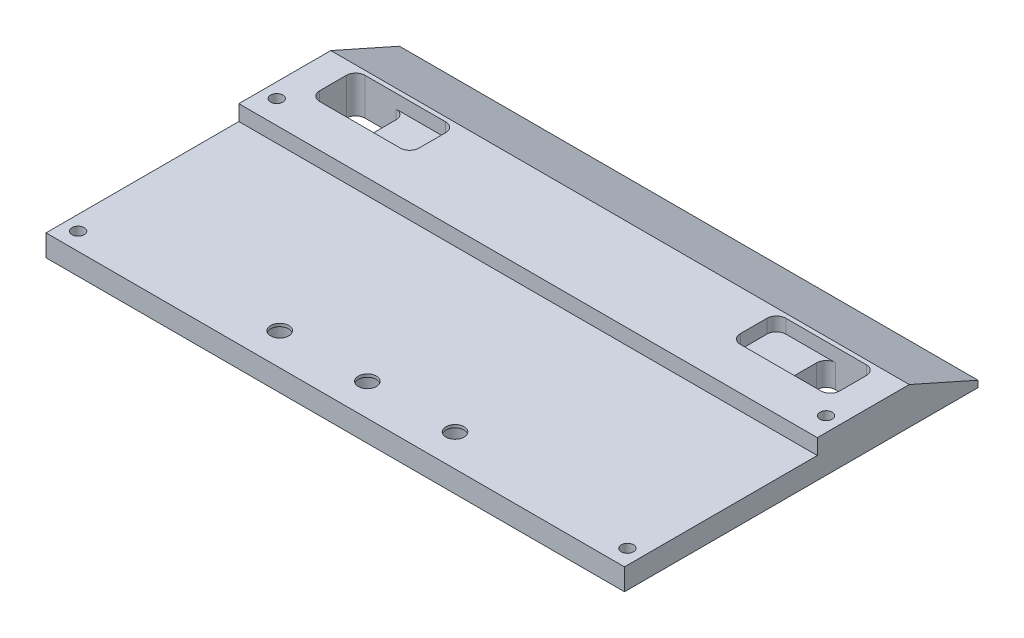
ISO-10303-21;
HEADER;
FILE_DESCRIPTION(('STEP AP214'),'2;1');
FILE_NAME('part.step','',(''),(''),'','','');
FILE_SCHEMA(('AUTOMOTIVE_DESIGN { 1 0 10303 214 1 1 1 1 }'));
ENDSEC;
DATA;
#1=APPLICATION_CONTEXT('core data for automotive mechanical design processes');
#2=APPLICATION_PROTOCOL_DEFINITION('international standard','automotive_design',2000,#1);
#3=PRODUCT_CONTEXT('',#1,'mechanical');
#4=PRODUCT('Part','Part','',(#3));
#5=PRODUCT_RELATED_PRODUCT_CATEGORY('part','',(#4));
#6=PRODUCT_DEFINITION_FORMATION('','',#4);
#7=PRODUCT_DEFINITION_CONTEXT('part definition',#1,'design');
#8=PRODUCT_DEFINITION('design','',#6,#7);
#9=PRODUCT_DEFINITION_SHAPE('','',#8);
#10=(LENGTH_UNIT() NAMED_UNIT(*) SI_UNIT(.MILLI.,.METRE.));
#11=(NAMED_UNIT(*) PLANE_ANGLE_UNIT() SI_UNIT($,.RADIAN.));
#12=(NAMED_UNIT(*) SI_UNIT($,.STERADIAN.) SOLID_ANGLE_UNIT());
#13=UNCERTAINTY_MEASURE_WITH_UNIT(LENGTH_MEASURE(1.E-05),#10,'distance_accuracy_value','');
#14=(GEOMETRIC_REPRESENTATION_CONTEXT(3) GLOBAL_UNCERTAINTY_ASSIGNED_CONTEXT((#13)) GLOBAL_UNIT_ASSIGNED_CONTEXT((#10,
#11,#12)) REPRESENTATION_CONTEXT('',''));
#15=CARTESIAN_POINT('',(0.,0.,0.));
#16=DIRECTION('',(0.,0.,1.));
#17=DIRECTION('',(1.,0.,0.));
#18=AXIS2_PLACEMENT_3D('',#15,#16,#17);
#19=CARTESIAN_POINT('',(-78.6,0.,-77.4));
#20=DIRECTION('',(0.,1.,0.));
#21=DIRECTION('',(0.,0.,1.));
#22=AXIS2_PLACEMENT_3D('',#19,#20,#21);
#23=CYLINDRICAL_SURFACE('',#22,1.6);
#24=CARTESIAN_POINT('',(-78.6,4.,-77.4));
#25=DIRECTION('',(0.,-1.,0.));
#26=DIRECTION('',(0.,0.,-1.));
#27=AXIS2_PLACEMENT_3D('',#24,#25,#26);
#28=CIRCLE('',#27,1.6);
#29=CARTESIAN_POINT('',(-78.6,4.,-79.));
#30=VERTEX_POINT('',#29);
#31=CARTESIAN_POINT('',(-77.,4.,-77.4));
#32=VERTEX_POINT('',#31);
#33=EDGE_CURVE('E286',#30,#32,#28,.T.);
#34=ORIENTED_EDGE('',*,*,#33,.T.);
#35=DIRECTION('',(0.,1.,0.));
#36=VECTOR('',#35,1.);
#37=CARTESIAN_POINT('',(-77.,0.,-77.4));
#38=LINE('',#37,#36);
#39=CARTESIAN_POINT('',(-77.,6.35,-77.4));
#40=VERTEX_POINT('',#39);
#41=EDGE_CURVE('E301',#32,#40,#38,.T.);
#42=ORIENTED_EDGE('',*,*,#41,.T.);
#43=CARTESIAN_POINT('',(-78.6,6.35,-77.4));
#44=DIRECTION('',(0.,1.,0.));
#45=DIRECTION('',(0.,0.,-1.));
#46=AXIS2_PLACEMENT_3D('',#43,#44,#45);
#47=CIRCLE('',#46,1.6);
#48=CARTESIAN_POINT('',(-78.6,6.35,-79.));
#49=VERTEX_POINT('',#48);
#50=EDGE_CURVE('E364',#40,#49,#47,.T.);
#51=ORIENTED_EDGE('',*,*,#50,.T.);
#52=DIRECTION('',(0.,1.,0.));
#53=VECTOR('',#52,1.);
#54=CARTESIAN_POINT('',(-78.6,0.,-79.));
#55=LINE('',#54,#53);
#56=EDGE_CURVE('E401',#30,#49,#55,.T.);
#57=ORIENTED_EDGE('',*,*,#56,.F.);
#58=EDGE_LOOP('',(#34,#42,#51,#57));
#59=FACE_BOUND('',#58,.T.);
#60=ADVANCED_FACE('F47',(#59),#23,.F.);
#61=CARTESIAN_POINT('',(-77.,0.,-77.4));
#62=DIRECTION('',(1.,0.,0.));
#63=DIRECTION('',(0.,0.,-1.));
#64=AXIS2_PLACEMENT_3D('',#61,#62,#63);
#65=PLANE('',#64);
#66=DIRECTION('',(0.,0.,1.));
#67=VECTOR('',#66,1.);
#68=CARTESIAN_POINT('',(-77.,4.,-72.83));
#69=LINE('',#68,#67);
#70=CARTESIAN_POINT('',(-77.,4.,-72.83));
#71=VERTEX_POINT('',#70);
#72=EDGE_CURVE('E289',#32,#71,#69,.T.);
#73=ORIENTED_EDGE('',*,*,#72,.T.);
#74=DIRECTION('',(0.,1.,0.));
#75=VECTOR('',#74,1.);
#76=CARTESIAN_POINT('',(-77.,0.,-72.83));
#77=LINE('',#76,#75);
#78=CARTESIAN_POINT('',(-77.,6.35,-72.83));
#79=VERTEX_POINT('',#78);
#80=EDGE_CURVE('E414',#71,#79,#77,.T.);
#81=ORIENTED_EDGE('',*,*,#80,.T.);
#82=DIRECTION('',(0.,0.,-1.));
#83=VECTOR('',#82,1.);
#84=CARTESIAN_POINT('',(-77.,6.35,-77.4));
#85=LINE('',#84,#83);
#86=EDGE_CURVE('E417',#79,#40,#85,.T.);
#87=ORIENTED_EDGE('',*,*,#86,.T.);
#88=ORIENTED_EDGE('',*,*,#41,.F.);
#89=EDGE_LOOP('',(#73,#81,#87,#88));
#90=FACE_BOUND('',#89,.T.);
#91=ADVANCED_FACE('F578',(#90),#65,.F.);
#92=CARTESIAN_POINT('',(-78.6,0.,-72.83));
#93=DIRECTION('',(0.,1.,0.));
#94=DIRECTION('',(0.,0.,1.));
#95=AXIS2_PLACEMENT_3D('',#92,#93,#94);
#96=CYLINDRICAL_SURFACE('',#95,1.6);
#97=CARTESIAN_POINT('',(-78.6,4.,-72.83));
#98=DIRECTION('',(0.,-1.,0.));
#99=DIRECTION('',(0.,0.,-1.));
#100=AXIS2_PLACEMENT_3D('',#97,#98,#99);
#101=CIRCLE('',#100,1.6);
#102=CARTESIAN_POINT('',(-78.6,4.,-71.23));
#103=VERTEX_POINT('',#102);
#104=EDGE_CURVE('E292',#71,#103,#101,.T.);
#105=ORIENTED_EDGE('',*,*,#104,.T.);
#106=DIRECTION('',(0.,1.,0.));
#107=VECTOR('',#106,1.);
#108=CARTESIAN_POINT('',(-78.6,0.,-71.23));
#109=LINE('',#108,#107);
#110=CARTESIAN_POINT('',(-78.6,6.35,-71.23));
#111=VERTEX_POINT('',#110);
#112=EDGE_CURVE('E412',#103,#111,#109,.T.);
#113=ORIENTED_EDGE('',*,*,#112,.T.);
#114=CARTESIAN_POINT('',(-78.6,6.35,-72.83));
#115=DIRECTION('',(0.,1.,0.));
#116=DIRECTION('',(0.,0.,1.));
#117=AXIS2_PLACEMENT_3D('',#114,#115,#116);
#118=CIRCLE('',#117,1.6);
#119=EDGE_CURVE('E420',#111,#79,#118,.T.);
#120=ORIENTED_EDGE('',*,*,#119,.T.);
#121=ORIENTED_EDGE('',*,*,#80,.F.);
#122=EDGE_LOOP('',(#105,#113,#120,#121));
#123=FACE_BOUND('',#122,.T.);
#124=ADVANCED_FACE('F585',(#123),#96,.F.);
#125=CARTESIAN_POINT('',(-92.4,0.,-71.23));
#126=DIRECTION('',(0.,0.,1.));
#127=DIRECTION('',(0.,-1.,0.));
#128=AXIS2_PLACEMENT_3D('',#125,#126,#127);
#129=PLANE('',#128);
#130=DIRECTION('',(0.,-1.,0.));
#131=VECTOR('',#130,1.);
#132=CARTESIAN_POINT('',(-87.1,4.,-71.23));
#133=LINE('',#132,#131);
#134=CARTESIAN_POINT('',(-87.1,4.,-71.23));
#135=VERTEX_POINT('',#134);
#136=CARTESIAN_POINT('',(-87.1,0.,-71.23));
#137=VERTEX_POINT('',#136);
#138=EDGE_CURVE('E275',#135,#137,#133,.T.);
#139=ORIENTED_EDGE('',*,*,#138,.T.);
#140=DIRECTION('',(1.,0.,0.));
#141=VECTOR('',#140,1.);
#142=CARTESIAN_POINT('',(-92.4,0.,-71.23));
#143=LINE('',#142,#141);
#144=CARTESIAN_POINT('',(-92.4,0.,-71.23));
#145=VERTEX_POINT('',#144);
#146=EDGE_CURVE('E403',#145,#137,#143,.T.);
#147=ORIENTED_EDGE('',*,*,#146,.F.);
#148=DIRECTION('',(0.,1.,0.));
#149=VECTOR('',#148,1.);
#150=CARTESIAN_POINT('',(-92.4,0.,-71.23));
#151=LINE('',#150,#149);
#152=CARTESIAN_POINT('',(-92.4,6.35,-71.23));
#153=VERTEX_POINT('',#152);
#154=EDGE_CURVE('E410',#145,#153,#151,.T.);
#155=ORIENTED_EDGE('',*,*,#154,.T.);
#156=DIRECTION('',(1.,0.,0.));
#157=VECTOR('',#156,1.);
#158=CARTESIAN_POINT('',(-92.4,6.35,-71.23));
#159=LINE('',#158,#157);
#160=EDGE_CURVE('E423',#153,#111,#159,.T.);
#161=ORIENTED_EDGE('',*,*,#160,.T.);
#162=ORIENTED_EDGE('',*,*,#112,.F.);
#163=DIRECTION('',(-1.,0.,0.));
#164=VECTOR('',#163,1.);
#165=CARTESIAN_POINT('',(-87.1,4.,-71.23));
#166=LINE('',#165,#164);
#167=EDGE_CURVE('E262',#103,#135,#166,.T.);
#168=ORIENTED_EDGE('',*,*,#167,.T.);
#169=EDGE_LOOP('',(#139,#147,#155,#161,#162,#168));
#170=FACE_BOUND('',#169,.T.);
#171=ADVANCED_FACE('F609',(#170),#129,.F.);
#172=CARTESIAN_POINT('',(-20.4,0.,-72.83));
#173=DIRECTION('',(0.,1.,0.));
#174=DIRECTION('',(0.,0.,1.));
#175=AXIS2_PLACEMENT_3D('',#172,#173,#174);
#176=CYLINDRICAL_SURFACE('',#175,1.6);
#177=CARTESIAN_POINT('',(-20.4,4.,-72.83));
#178=DIRECTION('',(0.,-1.,0.));
#179=DIRECTION('',(0.,0.,-1.));
#180=AXIS2_PLACEMENT_3D('',#177,#178,#179);
#181=CIRCLE('',#180,1.6);
#182=CARTESIAN_POINT('',(-20.4,4.,-71.23));
#183=VERTEX_POINT('',#182);
#184=CARTESIAN_POINT('',(-22.,4.,-72.83));
#185=VERTEX_POINT('',#184);
#186=EDGE_CURVE('E319',#183,#185,#181,.T.);
#187=ORIENTED_EDGE('',*,*,#186,.T.);
#188=DIRECTION('',(0.,1.,0.));
#189=VECTOR('',#188,1.);
#190=CARTESIAN_POINT('',(-22.,0.,-72.83));
#191=LINE('',#190,#189);
#192=CARTESIAN_POINT('',(-22.,6.35,-72.83));
#193=VERTEX_POINT('',#192);
#194=EDGE_CURVE('E393',#185,#193,#191,.T.);
#195=ORIENTED_EDGE('',*,*,#194,.T.);
#196=CARTESIAN_POINT('',(-20.4,6.35,-72.83));
#197=DIRECTION('',(0.,1.,0.));
#198=DIRECTION('',(0.,0.,-1.));
#199=AXIS2_PLACEMENT_3D('',#196,#197,#198);
#200=CIRCLE('',#199,1.6);
#201=CARTESIAN_POINT('',(-20.4,6.35,-71.23));
#202=VERTEX_POINT('',#201);
#203=EDGE_CURVE('E373',#193,#202,#200,.T.);
#204=ORIENTED_EDGE('',*,*,#203,.T.);
#205=DIRECTION('',(0.,1.,0.));
#206=VECTOR('',#205,1.);
#207=CARTESIAN_POINT('',(-20.4,0.,-71.23));
#208=LINE('',#207,#206);
#209=EDGE_CURVE('E391',#183,#202,#208,.T.);
#210=ORIENTED_EDGE('',*,*,#209,.F.);
#211=EDGE_LOOP('',(#187,#195,#204,#210));
#212=FACE_BOUND('',#211,.T.);
#213=ADVANCED_FACE('F612',(#212),#176,.F.);
#214=CARTESIAN_POINT('',(-22.,0.,-77.4));
#215=DIRECTION('',(-1.,0.,0.));
#216=DIRECTION('',(0.,0.,1.));
#217=AXIS2_PLACEMENT_3D('',#214,#215,#216);
#218=PLANE('',#217);
#219=DIRECTION('',(0.,0.,-1.));
#220=VECTOR('',#219,1.);
#221=CARTESIAN_POINT('',(-22.,4.,-77.4));
#222=LINE('',#221,#220);
#223=CARTESIAN_POINT('',(-22.,4.,-77.4));
#224=VERTEX_POINT('',#223);
#225=EDGE_CURVE('E340',#185,#224,#222,.T.);
#226=ORIENTED_EDGE('',*,*,#225,.T.);
#227=DIRECTION('',(0.,1.,0.));
#228=VECTOR('',#227,1.);
#229=CARTESIAN_POINT('',(-22.,0.,-77.4));
#230=LINE('',#229,#228);
#231=CARTESIAN_POINT('',(-22.,6.35,-77.4));
#232=VERTEX_POINT('',#231);
#233=EDGE_CURVE('E395',#224,#232,#230,.T.);
#234=ORIENTED_EDGE('',*,*,#233,.T.);
#235=DIRECTION('',(0.,0.,1.));
#236=VECTOR('',#235,1.);
#237=CARTESIAN_POINT('',(-22.,6.35,-77.4));
#238=LINE('',#237,#236);
#239=EDGE_CURVE('E370',#232,#193,#238,.T.);
#240=ORIENTED_EDGE('',*,*,#239,.T.);
#241=ORIENTED_EDGE('',*,*,#194,.F.);
#242=EDGE_LOOP('',(#226,#234,#240,#241));
#243=FACE_BOUND('',#242,.T.);
#244=ADVANCED_FACE('F711',(#243),#218,.F.);
#245=CARTESIAN_POINT('',(-20.4,0.,-77.4));
#246=DIRECTION('',(0.,1.,0.));
#247=DIRECTION('',(0.,0.,1.));
#248=AXIS2_PLACEMENT_3D('',#245,#246,#247);
#249=CYLINDRICAL_SURFACE('',#248,1.6);
#250=CARTESIAN_POINT('',(-20.4,4.,-77.4));
#251=DIRECTION('',(0.,-1.,0.));
#252=DIRECTION('',(0.,0.,-1.));
#253=AXIS2_PLACEMENT_3D('',#250,#251,#252);
#254=CIRCLE('',#253,1.6);
#255=CARTESIAN_POINT('',(-20.4,4.,-79.));
#256=VERTEX_POINT('',#255);
#257=EDGE_CURVE('E337',#224,#256,#254,.T.);
#258=ORIENTED_EDGE('',*,*,#257,.T.);
#259=DIRECTION('',(0.,1.,0.));
#260=VECTOR('',#259,1.);
#261=CARTESIAN_POINT('',(-20.4,0.,-79.));
#262=LINE('',#261,#260);
#263=CARTESIAN_POINT('',(-20.4,6.35,-79.));
#264=VERTEX_POINT('',#263);
#265=EDGE_CURVE('E397',#256,#264,#262,.T.);
#266=ORIENTED_EDGE('',*,*,#265,.T.);
#267=CARTESIAN_POINT('',(-20.4,6.35,-77.4));
#268=DIRECTION('',(0.,1.,0.));
#269=DIRECTION('',(0.,0.,1.));
#270=AXIS2_PLACEMENT_3D('',#267,#268,#269);
#271=CIRCLE('',#270,1.6);
#272=EDGE_CURVE('E367',#264,#232,#271,.T.);
#273=ORIENTED_EDGE('',*,*,#272,.T.);
#274=ORIENTED_EDGE('',*,*,#233,.F.);
#275=EDGE_LOOP('',(#258,#266,#273,#274));
#276=FACE_BOUND('',#275,.T.);
#277=ADVANCED_FACE('F706',(#276),#249,.F.);
#278=CARTESIAN_POINT('',(-6.6,0.,-79.));
#279=DIRECTION('',(0.,0.,-1.));
#280=DIRECTION('',(0.,1.,0.));
#281=AXIS2_PLACEMENT_3D('',#278,#279,#280);
#282=PLANE('',#281);
#283=DIRECTION('',(0.,-1.,0.));
#284=VECTOR('',#283,1.);
#285=CARTESIAN_POINT('',(-11.9,4.,-79.));
#286=LINE('',#285,#284);
#287=CARTESIAN_POINT('',(-11.9,4.,-79.));
#288=VERTEX_POINT('',#287);
#289=CARTESIAN_POINT('',(-11.9,0.,-79.));
#290=VERTEX_POINT('',#289);
#291=EDGE_CURVE('E305',#288,#290,#286,.T.);
#292=ORIENTED_EDGE('',*,*,#291,.T.);
#293=DIRECTION('',(-1.,0.,0.));
#294=VECTOR('',#293,1.);
#295=CARTESIAN_POINT('',(-6.6,0.,-79.));
#296=LINE('',#295,#294);
#297=CARTESIAN_POINT('',(-6.6,0.,-79.));
#298=VERTEX_POINT('',#297);
#299=EDGE_CURVE('E348',#298,#290,#296,.T.);
#300=ORIENTED_EDGE('',*,*,#299,.F.);
#301=DIRECTION('',(0.,1.,0.));
#302=VECTOR('',#301,1.);
#303=CARTESIAN_POINT('',(-6.6,0.,-79.));
#304=LINE('',#303,#302);
#305=CARTESIAN_POINT('',(-6.59999999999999,6.35,-79.));
#306=VERTEX_POINT('',#305);
#307=EDGE_CURVE('E360',#298,#306,#304,.T.);
#308=ORIENTED_EDGE('',*,*,#307,.T.);
#309=DIRECTION('',(-1.,0.,0.));
#310=VECTOR('',#309,1.);
#311=CARTESIAN_POINT('',(-6.6,6.35,-79.));
#312=LINE('',#311,#310);
#313=EDGE_CURVE('E363',#306,#264,#312,.T.);
#314=ORIENTED_EDGE('',*,*,#313,.T.);
#315=ORIENTED_EDGE('',*,*,#265,.F.);
#316=DIRECTION('',(1.,0.,0.));
#317=VECTOR('',#316,1.);
#318=CARTESIAN_POINT('',(-11.9,4.,-79.));
#319=LINE('',#318,#317);
#320=EDGE_CURVE('E334',#256,#288,#319,.T.);
#321=ORIENTED_EDGE('',*,*,#320,.T.);
#322=EDGE_LOOP('',(#292,#300,#308,#314,#315,#321));
#323=FACE_BOUND('',#322,.T.);
#324=ADVANCED_FACE('F702',(#323),#282,.F.);
#325=CARTESIAN_POINT('',(-99.,0.,-91.5));
#326=DIRECTION('',(0.,0.,1.));
#327=DIRECTION('',(1.,0.,0.));
#328=AXIS2_PLACEMENT_3D('',#325,#326,#327);
#329=PLANE('',#328);
#330=DIRECTION('',(0.,-1.,0.));
#331=VECTOR('',#330,1.);
#332=CARTESIAN_POINT('',(0.,0.,-91.5));
#333=LINE('',#332,#331);
#334=CARTESIAN_POINT('',(0.,1.11307171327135,-91.5));
#335=VERTEX_POINT('',#334);
#336=CARTESIAN_POINT('',(0.,0.,-91.5));
#337=VERTEX_POINT('',#336);
#338=EDGE_CURVE('E466',#335,#337,#333,.T.);
#339=ORIENTED_EDGE('',*,*,#338,.T.);
#340=DIRECTION('',(1.,0.,0.));
#341=VECTOR('',#340,1.);
#342=CARTESIAN_POINT('',(-99.,0.,-91.5));
#343=LINE('',#342,#341);
#344=CARTESIAN_POINT('',(-99.,0.,-91.5));
#345=VERTEX_POINT('',#344);
#346=EDGE_CURVE('E11',#345,#337,#343,.T.);
#347=ORIENTED_EDGE('',*,*,#346,.F.);
#348=DIRECTION('',(0.,-1.,0.));
#349=VECTOR('',#348,1.);
#350=CARTESIAN_POINT('',(-99.,0.,-91.5));
#351=LINE('',#350,#349);
#352=CARTESIAN_POINT('',(-99.,1.11307171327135,-91.5));
#353=VERTEX_POINT('',#352);
#354=EDGE_CURVE('E481',#353,#345,#351,.T.);
#355=ORIENTED_EDGE('',*,*,#354,.F.);
#356=DIRECTION('',(1.,0.,0.));
#357=VECTOR('',#356,1.);
#358=CARTESIAN_POINT('',(-99.,1.11307171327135,-91.5));
#359=LINE('',#358,#357);
#360=EDGE_CURVE('E502',#353,#335,#359,.T.);
#361=ORIENTED_EDGE('',*,*,#360,.T.);
#362=EDGE_LOOP('',(#339,#347,#355,#361));
#363=FACE_BOUND('',#362,.T.);
#364=ADVANCED_FACE('F49',(#363),#329,.F.);
#365=CARTESIAN_POINT('',(-99.,0.,0.));
#366=DIRECTION('',(0.,1.,0.));
#367=DIRECTION('',(0.,0.,1.));
#368=AXIS2_PLACEMENT_3D('',#365,#366,#367);
#369=PLANE('',#368);
#370=CARTESIAN_POINT('',(-96.5,0.,-68.));
#371=DIRECTION('',(0.,1.,0.));
#372=DIRECTION('',(0.,0.,-1.));
#373=AXIS2_PLACEMENT_3D('',#370,#371,#372);
#374=CIRCLE('',#373,1.04999999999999);
#375=CARTESIAN_POINT('',(-96.5,0.,-69.05));
#376=VERTEX_POINT('',#375);
#377=EDGE_CURVE('E549',#376,#376,#374,.T.);
#378=ORIENTED_EDGE('',*,*,#377,.T.);
#379=EDGE_LOOP('',(#378));
#380=FACE_BOUND('',#379,.T.);
#381=CARTESIAN_POINT('',(-96.5,0.,-34.));
#382=DIRECTION('',(0.,1.,0.));
#383=DIRECTION('',(0.,0.,-1.));
#384=AXIS2_PLACEMENT_3D('',#381,#382,#383);
#385=CIRCLE('',#384,1.04999999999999);
#386=CARTESIAN_POINT('',(-96.5,0.,-35.05));
#387=VERTEX_POINT('',#386);
#388=EDGE_CURVE('E555',#387,#387,#385,.T.);
#389=ORIENTED_EDGE('',*,*,#388,.T.);
#390=EDGE_LOOP('',(#389));
#391=FACE_BOUND('',#390,.T.);
#392=CARTESIAN_POINT('',(-2.5,0.,-34.));
#393=DIRECTION('',(0.,1.,0.));
#394=DIRECTION('',(0.,0.,1.));
#395=AXIS2_PLACEMENT_3D('',#392,#393,#394);
#396=CIRCLE('',#395,1.05);
#397=CARTESIAN_POINT('',(-2.5,0.,-32.95));
#398=VERTEX_POINT('',#397);
#399=EDGE_CURVE('E547',#398,#398,#396,.T.);
#400=ORIENTED_EDGE('',*,*,#399,.T.);
#401=EDGE_LOOP('',(#400));
#402=FACE_BOUND('',#401,.T.);
#403=CARTESIAN_POINT('',(-2.5,0.,-68.));
#404=DIRECTION('',(0.,1.,0.));
#405=DIRECTION('',(0.,0.,1.));
#406=AXIS2_PLACEMENT_3D('',#403,#404,#405);
#407=CIRCLE('',#406,1.05);
#408=CARTESIAN_POINT('',(-2.5,0.,-66.95));
#409=VERTEX_POINT('',#408);
#410=EDGE_CURVE('E539',#409,#409,#407,.T.);
#411=ORIENTED_EDGE('',*,*,#410,.T.);
#412=EDGE_LOOP('',(#411));
#413=FACE_BOUND('',#412,.T.);
#414=ORIENTED_EDGE('',*,*,#146,.T.);
#415=CARTESIAN_POINT('',(-87.1,0.,-72.83));
#416=DIRECTION('',(0.,1.,0.));
#417=DIRECTION('',(0.,0.,-1.));
#418=AXIS2_PLACEMENT_3D('',#415,#416,#417);
#419=CIRCLE('',#418,1.6);
#420=CARTESIAN_POINT('',(-85.5,0.,-72.83));
#421=VERTEX_POINT('',#420);
#422=EDGE_CURVE('E296',#137,#421,#419,.T.);
#423=ORIENTED_EDGE('',*,*,#422,.T.);
#424=DIRECTION('',(0.,0.,-1.));
#425=VECTOR('',#424,1.);
#426=CARTESIAN_POINT('',(-85.5,0.,-72.83));
#427=LINE('',#426,#425);
#428=CARTESIAN_POINT('',(-85.5,0.,-77.4));
#429=VERTEX_POINT('',#428);
#430=EDGE_CURVE('E257',#421,#429,#427,.T.);
#431=ORIENTED_EDGE('',*,*,#430,.T.);
#432=CARTESIAN_POINT('',(-87.1,0.,-77.4));
#433=DIRECTION('',(0.,1.,0.));
#434=DIRECTION('',(0.,0.,1.));
#435=AXIS2_PLACEMENT_3D('',#432,#433,#434);
#436=CIRCLE('',#435,1.6);
#437=CARTESIAN_POINT('',(-87.1,0.,-79.));
#438=VERTEX_POINT('',#437);
#439=EDGE_CURVE('E64',#429,#438,#436,.T.);
#440=ORIENTED_EDGE('',*,*,#439,.T.);
#441=DIRECTION('',(-1.,0.,0.));
#442=VECTOR('',#441,1.);
#443=CARTESIAN_POINT('',(-92.4,0.,-79.));
#444=LINE('',#443,#442);
#445=CARTESIAN_POINT('',(-92.4,0.,-79.));
#446=VERTEX_POINT('',#445);
#447=EDGE_CURVE('E69',#438,#446,#444,.T.);
#448=ORIENTED_EDGE('',*,*,#447,.T.);
#449=CARTESIAN_POINT('',(-92.4,0.,-77.4));
#450=DIRECTION('',(0.,1.,0.));
#451=DIRECTION('',(0.,0.,1.));
#452=AXIS2_PLACEMENT_3D('',#449,#450,#451);
#453=CIRCLE('',#452,1.60000000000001);
#454=CARTESIAN_POINT('',(-94.,0.,-77.4));
#455=VERTEX_POINT('',#454);
#456=EDGE_CURVE('E448',#446,#455,#453,.T.);
#457=ORIENTED_EDGE('',*,*,#456,.T.);
#458=DIRECTION('',(0.,0.,1.));
#459=VECTOR('',#458,1.);
#460=CARTESIAN_POINT('',(-94.,0.,-77.4));
#461=LINE('',#460,#459);
#462=CARTESIAN_POINT('',(-94.,0.,-72.83));
#463=VERTEX_POINT('',#462);
#464=EDGE_CURVE('E445',#455,#463,#461,.T.);
#465=ORIENTED_EDGE('',*,*,#464,.T.);
#466=CARTESIAN_POINT('',(-92.4,0.,-72.83));
#467=DIRECTION('',(0.,1.,0.));
#468=DIRECTION('',(0.,0.,1.));
#469=AXIS2_PLACEMENT_3D('',#466,#467,#468);
#470=CIRCLE('',#469,1.6);
#471=EDGE_CURVE('E442',#463,#145,#470,.T.);
#472=ORIENTED_EDGE('',*,*,#471,.T.);
#473=EDGE_LOOP('',(#414,#423,#431,#440,#448,#457,#465,#472));
#474=FACE_BOUND('',#473,.T.);
#475=CARTESIAN_POINT('',(-11.9,0.,-72.83));
#476=DIRECTION('',(0.,1.,0.));
#477=DIRECTION('',(0.,0.,1.));
#478=AXIS2_PLACEMENT_3D('',#475,#476,#477);
#479=CIRCLE('',#478,1.6);
#480=CARTESIAN_POINT('',(-13.5,0.,-72.83));
#481=VERTEX_POINT('',#480);
#482=CARTESIAN_POINT('',(-11.9,0.,-71.23));
#483=VERTEX_POINT('',#482);
#484=EDGE_CURVE('E315',#481,#483,#479,.T.);
#485=ORIENTED_EDGE('',*,*,#484,.T.);
#486=DIRECTION('',(1.,0.,0.));
#487=VECTOR('',#486,1.);
#488=CARTESIAN_POINT('',(-6.6,0.,-71.23));
#489=LINE('',#488,#487);
#490=CARTESIAN_POINT('',(-6.6,0.,-71.23));
#491=VERTEX_POINT('',#490);
#492=EDGE_CURVE('E352',#483,#491,#489,.T.);
#493=ORIENTED_EDGE('',*,*,#492,.T.);
#494=CARTESIAN_POINT('',(-6.6,0.,-72.83));
#495=DIRECTION('',(0.,1.,0.));
#496=DIRECTION('',(0.,0.,-1.));
#497=AXIS2_PLACEMENT_3D('',#494,#495,#496);
#498=CIRCLE('',#497,1.6);
#499=CARTESIAN_POINT('',(-5.,0.,-72.83));
#500=VERTEX_POINT('',#499);
#501=EDGE_CURVE('E354',#491,#500,#498,.T.);
#502=ORIENTED_EDGE('',*,*,#501,.T.);
#503=DIRECTION('',(0.,0.,-1.));
#504=VECTOR('',#503,1.);
#505=CARTESIAN_POINT('',(-5.,0.,-77.4));
#506=LINE('',#505,#504);
#507=CARTESIAN_POINT('',(-5.,0.,-77.4));
#508=VERTEX_POINT('',#507);
#509=EDGE_CURVE('E357',#500,#508,#506,.T.);
#510=ORIENTED_EDGE('',*,*,#509,.T.);
#511=CARTESIAN_POINT('',(-6.6,0.,-77.4));
#512=DIRECTION('',(0.,1.,0.));
#513=DIRECTION('',(0.,0.,-1.));
#514=AXIS2_PLACEMENT_3D('',#511,#512,#513);
#515=CIRCLE('',#514,1.6);
#516=EDGE_CURVE('E345',#508,#298,#515,.T.);
#517=ORIENTED_EDGE('',*,*,#516,.T.);
#518=ORIENTED_EDGE('',*,*,#299,.T.);
#519=CARTESIAN_POINT('',(-11.9,0.,-77.4));
#520=DIRECTION('',(0.,1.,0.));
#521=DIRECTION('',(0.,0.,-1.));
#522=AXIS2_PLACEMENT_3D('',#519,#520,#521);
#523=CIRCLE('',#522,1.6);
#524=CARTESIAN_POINT('',(-13.5,0.,-77.4));
#525=VERTEX_POINT('',#524);
#526=EDGE_CURVE('E298',#290,#525,#523,.T.);
#527=ORIENTED_EDGE('',*,*,#526,.T.);
#528=DIRECTION('',(0.,0.,1.));
#529=VECTOR('',#528,1.);
#530=CARTESIAN_POINT('',(-13.5,0.,-72.83));
#531=LINE('',#530,#529);
#532=EDGE_CURVE('E318',#525,#481,#531,.T.);
#533=ORIENTED_EDGE('',*,*,#532,.T.);
#534=EDGE_LOOP('',(#485,#493,#502,#510,#517,#518,#527,#533));
#535=FACE_BOUND('',#534,.T.);
#536=CARTESIAN_POINT('',(-64.5,0.,-36.5));
#537=DIRECTION('',(0.,-1.,0.));
#538=DIRECTION('',(0.,0.,-1.));
#539=AXIS2_PLACEMENT_3D('',#536,#537,#538);
#540=CIRCLE('',#539,2.85);
#541=CARTESIAN_POINT('',(-64.5,0.,-39.35));
#542=VERTEX_POINT('',#541);
#543=EDGE_CURVE('E467',#542,#542,#540,.T.);
#544=ORIENTED_EDGE('',*,*,#543,.F.);
#545=EDGE_LOOP('',(#544));
#546=FACE_BOUND('',#545,.T.);
#547=CARTESIAN_POINT('',(-49.5,0.,-36.5));
#548=DIRECTION('',(0.,-1.,0.));
#549=DIRECTION('',(0.,0.,-1.));
#550=AXIS2_PLACEMENT_3D('',#547,#548,#549);
#551=CIRCLE('',#550,2.85);
#552=CARTESIAN_POINT('',(-49.5,0.,-39.35));
#553=VERTEX_POINT('',#552);
#554=EDGE_CURVE('E473',#553,#553,#551,.T.);
#555=ORIENTED_EDGE('',*,*,#554,.F.);
#556=EDGE_LOOP('',(#555));
#557=FACE_BOUND('',#556,.T.);
#558=CARTESIAN_POINT('',(-34.5,0.,-36.5));
#559=DIRECTION('',(0.,-1.,0.));
#560=DIRECTION('',(0.,0.,-1.));
#561=AXIS2_PLACEMENT_3D('',#558,#559,#560);
#562=CIRCLE('',#561,2.85);
#563=CARTESIAN_POINT('',(-34.5,0.,-39.35));
#564=VERTEX_POINT('',#563);
#565=EDGE_CURVE('E462',#564,#564,#562,.T.);
#566=ORIENTED_EDGE('',*,*,#565,.F.);
#567=EDGE_LOOP('',(#566));
#568=FACE_BOUND('',#567,.T.);
#569=DIRECTION('',(0.,0.,1.));
#570=VECTOR('',#569,1.);
#571=CARTESIAN_POINT('',(0.,0.,0.));
#572=LINE('',#571,#570);
#573=CARTESIAN_POINT('',(0.,0.,-31.));
#574=VERTEX_POINT('',#573);
#575=EDGE_CURVE('E485',#337,#574,#572,.T.);
#576=ORIENTED_EDGE('',*,*,#575,.T.);
#577=DIRECTION('',(1.,0.,0.));
#578=VECTOR('',#577,1.);
#579=CARTESIAN_POINT('',(-99.,0.,-31.));
#580=LINE('',#579,#578);
#581=CARTESIAN_POINT('',(-99.,0.,-31.));
#582=VERTEX_POINT('',#581);
#583=EDGE_CURVE('E56',#582,#574,#580,.T.);
#584=ORIENTED_EDGE('',*,*,#583,.F.);
#585=DIRECTION('',(0.,0.,1.));
#586=VECTOR('',#585,1.);
#587=CARTESIAN_POINT('',(-99.,0.,0.));
#588=LINE('',#587,#586);
#589=EDGE_CURVE('E500',#345,#582,#588,.T.);
#590=ORIENTED_EDGE('',*,*,#589,.F.);
#591=ORIENTED_EDGE('',*,*,#346,.T.);
#592=EDGE_LOOP('',(#576,#584,#590,#591));
#593=FACE_BOUND('',#592,.T.);
#594=ADVANCED_FACE('F561',(#380,#391,#402,#413,#474,#535,#546,#557,#568,#593),#369,.F.);
#595=CARTESIAN_POINT('',(-99.,1.16273357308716E-13,-31.));
#596=DIRECTION('',(0.,0.,1.));
#597=DIRECTION('',(0.,-1.,0.));
#598=AXIS2_PLACEMENT_3D('',#595,#596,#597);
#599=PLANE('',#598);
#600=DIRECTION('',(0.,-1.,0.));
#601=VECTOR('',#600,1.);
#602=CARTESIAN_POINT('',(0.,1.16273357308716E-13,-31.));
#603=LINE('',#602,#601);
#604=CARTESIAN_POINT('',(0.,3.7,-31.));
#605=VERTEX_POINT('',#604);
#606=EDGE_CURVE('E517',#605,#574,#603,.T.);
#607=ORIENTED_EDGE('',*,*,#606,.F.);
#608=DIRECTION('',(1.,0.,0.));
#609=VECTOR('',#608,1.);
#610=CARTESIAN_POINT('',(-99.,3.7,-31.));
#611=LINE('',#610,#609);
#612=CARTESIAN_POINT('',(-99.,3.7,-31.));
#613=VERTEX_POINT('',#612);
#614=EDGE_CURVE('E523',#613,#605,#611,.T.);
#615=ORIENTED_EDGE('',*,*,#614,.F.);
#616=DIRECTION('',(0.,-1.,0.));
#617=VECTOR('',#616,1.);
#618=CARTESIAN_POINT('',(-99.,1.16273357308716E-13,-31.));
#619=LINE('',#618,#617);
#620=EDGE_CURVE('E497',#613,#582,#619,.T.);
#621=ORIENTED_EDGE('',*,*,#620,.T.);
#622=ORIENTED_EDGE('',*,*,#583,.T.);
#623=EDGE_LOOP('',(#607,#615,#621,#622));
#624=FACE_BOUND('',#623,.T.);
#625=ADVANCED_FACE('F663',(#624),#599,.T.);
#626=CARTESIAN_POINT('',(-99.,3.7,0.));
#627=DIRECTION('',(0.,1.,0.));
#628=DIRECTION('',(0.,0.,1.));
#629=AXIS2_PLACEMENT_3D('',#626,#627,#628);
#630=PLANE('',#629);
#631=CARTESIAN_POINT('',(-96.5,3.7,-34.));
#632=DIRECTION('',(0.,1.,0.));
#633=DIRECTION('',(0.,0.,1.));
#634=AXIS2_PLACEMENT_3D('',#631,#632,#633);
#635=CIRCLE('',#634,1.04999999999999);
#636=CARTESIAN_POINT('',(-96.5,3.7,-32.95));
#637=VERTEX_POINT('',#636);
#638=EDGE_CURVE('E51',#637,#637,#635,.T.);
#639=ORIENTED_EDGE('',*,*,#638,.F.);
#640=EDGE_LOOP('',(#639));
#641=FACE_BOUND('',#640,.T.);
#642=CARTESIAN_POINT('',(-2.5,3.7,-34.));
#643=DIRECTION('',(0.,1.,0.));
#644=DIRECTION('',(0.,0.,1.));
#645=AXIS2_PLACEMENT_3D('',#642,#643,#644);
#646=CIRCLE('',#645,1.05);
#647=CARTESIAN_POINT('',(-2.5,3.7,-32.95));
#648=VERTEX_POINT('',#647);
#649=EDGE_CURVE('E537',#648,#648,#646,.T.);
#650=ORIENTED_EDGE('',*,*,#649,.F.);
#651=EDGE_LOOP('',(#650));
#652=FACE_BOUND('',#651,.T.);
#653=CARTESIAN_POINT('',(-64.5,3.7,-36.5));
#654=DIRECTION('',(0.,1.,0.));
#655=DIRECTION('',(0.,0.,1.));
#656=AXIS2_PLACEMENT_3D('',#653,#654,#655);
#657=CIRCLE('',#656,1.54999999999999);
#658=CARTESIAN_POINT('',(-64.5,3.7,-34.95));
#659=VERTEX_POINT('',#658);
#660=EDGE_CURVE('E451',#659,#659,#657,.T.);
#661=ORIENTED_EDGE('',*,*,#660,.F.);
#662=EDGE_LOOP('',(#661));
#663=FACE_BOUND('',#662,.T.);
#664=CARTESIAN_POINT('',(-49.5,3.7,-36.5));
#665=DIRECTION('',(0.,1.,0.));
#666=DIRECTION('',(0.,0.,1.));
#667=AXIS2_PLACEMENT_3D('',#664,#665,#666);
#668=CIRCLE('',#667,1.55);
#669=CARTESIAN_POINT('',(-49.5,3.7,-34.95));
#670=VERTEX_POINT('',#669);
#671=EDGE_CURVE('E455',#670,#670,#668,.T.);
#672=ORIENTED_EDGE('',*,*,#671,.F.);
#673=EDGE_LOOP('',(#672));
#674=FACE_BOUND('',#673,.T.);
#675=CARTESIAN_POINT('',(-34.5,3.7,-36.5));
#676=DIRECTION('',(0.,1.,0.));
#677=DIRECTION('',(0.,0.,1.));
#678=AXIS2_PLACEMENT_3D('',#675,#676,#677);
#679=CIRCLE('',#678,1.55);
#680=CARTESIAN_POINT('',(-34.5,3.7,-34.95));
#681=VERTEX_POINT('',#680);
#682=EDGE_CURVE('E459',#681,#681,#679,.T.);
#683=ORIENTED_EDGE('',*,*,#682,.F.);
#684=EDGE_LOOP('',(#683));
#685=FACE_BOUND('',#684,.T.);
#686=DIRECTION('',(0.,0.,1.));
#687=VECTOR('',#686,1.);
#688=CARTESIAN_POINT('',(0.,3.7,0.));
#689=LINE('',#688,#687);
#690=CARTESIAN_POINT('',(0.,3.70000000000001,-64.));
#691=VERTEX_POINT('',#690);
#692=EDGE_CURVE('E514',#691,#605,#689,.T.);
#693=ORIENTED_EDGE('',*,*,#692,.F.);
#694=DIRECTION('',(1.,0.,0.));
#695=VECTOR('',#694,1.);
#696=CARTESIAN_POINT('',(-99.,3.70000000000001,-64.));
#697=LINE('',#696,#695);
#698=CARTESIAN_POINT('',(-99.,3.70000000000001,-64.));
#699=VERTEX_POINT('',#698);
#700=EDGE_CURVE('E525',#699,#691,#697,.T.);
#701=ORIENTED_EDGE('',*,*,#700,.F.);
#702=DIRECTION('',(0.,0.,1.));
#703=VECTOR('',#702,1.);
#704=CARTESIAN_POINT('',(-99.,3.7,0.));
#705=LINE('',#704,#703);
#706=EDGE_CURVE('E494',#699,#613,#705,.T.);
#707=ORIENTED_EDGE('',*,*,#706,.T.);
#708=ORIENTED_EDGE('',*,*,#614,.T.);
#709=EDGE_LOOP('',(#693,#701,#707,#708));
#710=FACE_BOUND('',#709,.T.);
#711=ADVANCED_FACE('F667',(#641,#652,#663,#674,#685,#710),#630,.T.);
#712=CARTESIAN_POINT('',(-99.,0.,-64.));
#713=DIRECTION('',(0.,0.,1.));
#714=DIRECTION('',(1.,0.,0.));
#715=AXIS2_PLACEMENT_3D('',#712,#713,#714);
#716=PLANE('',#715);
#717=DIRECTION('',(0.,-1.,0.));
#718=VECTOR('',#717,1.);
#719=CARTESIAN_POINT('',(0.,0.,-64.));
#720=LINE('',#719,#718);
#721=CARTESIAN_POINT('',(0.,6.35,-64.));
#722=VERTEX_POINT('',#721);
#723=EDGE_CURVE('E511',#722,#691,#720,.T.);
#724=ORIENTED_EDGE('',*,*,#723,.F.);
#725=DIRECTION('',(1.,0.,0.));
#726=VECTOR('',#725,1.);
#727=CARTESIAN_POINT('',(-99.,6.35,-64.));
#728=LINE('',#727,#726);
#729=CARTESIAN_POINT('',(-99.,6.35,-64.));
#730=VERTEX_POINT('',#729);
#731=EDGE_CURVE('E527',#730,#722,#728,.T.);
#732=ORIENTED_EDGE('',*,*,#731,.F.);
#733=DIRECTION('',(0.,-1.,0.));
#734=VECTOR('',#733,1.);
#735=CARTESIAN_POINT('',(-99.,0.,-64.));
#736=LINE('',#735,#734);
#737=EDGE_CURVE('E491',#730,#699,#736,.T.);
#738=ORIENTED_EDGE('',*,*,#737,.T.);
#739=ORIENTED_EDGE('',*,*,#700,.T.);
#740=EDGE_LOOP('',(#724,#732,#738,#739));
#741=FACE_BOUND('',#740,.T.);
#742=ADVANCED_FACE('F671',(#741),#716,.T.);
#743=CARTESIAN_POINT('',(-99.,6.34999999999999,0.));
#744=DIRECTION('',(0.,1.,0.));
#745=DIRECTION('',(0.,0.,1.));
#746=AXIS2_PLACEMENT_3D('',#743,#744,#745);
#747=PLANE('',#746);
#748=CARTESIAN_POINT('',(-96.5,6.35,-68.));
#749=DIRECTION('',(0.,1.,0.));
#750=DIRECTION('',(0.,0.,-1.));
#751=AXIS2_PLACEMENT_3D('',#748,#749,#750);
#752=CIRCLE('',#751,1.04999999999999);
#753=CARTESIAN_POINT('',(-96.5,6.35,-69.05));
#754=VERTEX_POINT('',#753);
#755=EDGE_CURVE('E552',#754,#754,#752,.T.);
#756=ORIENTED_EDGE('',*,*,#755,.F.);
#757=EDGE_LOOP('',(#756));
#758=FACE_BOUND('',#757,.T.);
#759=CARTESIAN_POINT('',(-2.5,6.35,-68.));
#760=DIRECTION('',(0.,1.,0.));
#761=DIRECTION('',(0.,0.,1.));
#762=AXIS2_PLACEMENT_3D('',#759,#760,#761);
#763=CIRCLE('',#762,1.05);
#764=CARTESIAN_POINT('',(-2.5,6.35,-66.95));
#765=VERTEX_POINT('',#764);
#766=EDGE_CURVE('E279',#765,#765,#763,.T.);
#767=ORIENTED_EDGE('',*,*,#766,.F.);
#768=EDGE_LOOP('',(#767));
#769=FACE_BOUND('',#768,.T.);
#770=CARTESIAN_POINT('',(-6.6,6.35,-77.4));
#771=DIRECTION('',(0.,1.,0.));
#772=DIRECTION('',(0.,0.,-1.));
#773=AXIS2_PLACEMENT_3D('',#770,#771,#772);
#774=CIRCLE('',#773,1.6);
#775=CARTESIAN_POINT('',(-5.,6.35,-77.4));
#776=VERTEX_POINT('',#775);
#777=EDGE_CURVE('E361',#776,#306,#774,.T.);
#778=ORIENTED_EDGE('',*,*,#777,.F.);
#779=DIRECTION('',(0.,0.,-1.));
#780=VECTOR('',#779,1.);
#781=CARTESIAN_POINT('',(-5.,6.35,-77.4));
#782=LINE('',#781,#780);
#783=CARTESIAN_POINT('',(-5.,6.35,-72.83));
#784=VERTEX_POINT('',#783);
#785=EDGE_CURVE('E349',#784,#776,#782,.T.);
#786=ORIENTED_EDGE('',*,*,#785,.F.);
#787=CARTESIAN_POINT('',(-6.6,6.35,-72.83));
#788=DIRECTION('',(0.,1.,0.));
#789=DIRECTION('',(0.,0.,-1.));
#790=AXIS2_PLACEMENT_3D('',#787,#788,#789);
#791=CIRCLE('',#790,1.6);
#792=CARTESIAN_POINT('',(-6.6,6.35,-71.23));
#793=VERTEX_POINT('',#792);
#794=EDGE_CURVE('E379',#793,#784,#791,.T.);
#795=ORIENTED_EDGE('',*,*,#794,.F.);
#796=DIRECTION('',(1.,0.,0.));
#797=VECTOR('',#796,1.);
#798=CARTESIAN_POINT('',(-6.6,6.35,-71.23));
#799=LINE('',#798,#797);
#800=EDGE_CURVE('E376',#202,#793,#799,.T.);
#801=ORIENTED_EDGE('',*,*,#800,.F.);
#802=ORIENTED_EDGE('',*,*,#203,.F.);
#803=ORIENTED_EDGE('',*,*,#239,.F.);
#804=ORIENTED_EDGE('',*,*,#272,.F.);
#805=ORIENTED_EDGE('',*,*,#313,.F.);
#806=EDGE_LOOP('',(#778,#786,#795,#801,#802,#803,#804,#805));
#807=FACE_BOUND('',#806,.T.);
#808=ORIENTED_EDGE('',*,*,#50,.F.);
#809=ORIENTED_EDGE('',*,*,#86,.F.);
#810=ORIENTED_EDGE('',*,*,#119,.F.);
#811=ORIENTED_EDGE('',*,*,#160,.F.);
#812=CARTESIAN_POINT('',(-92.4,6.35,-72.83));
#813=DIRECTION('',(0.,1.,0.));
#814=DIRECTION('',(0.,0.,1.));
#815=AXIS2_PLACEMENT_3D('',#812,#813,#814);
#816=CIRCLE('',#815,1.6);
#817=CARTESIAN_POINT('',(-94.,6.35,-72.83));
#818=VERTEX_POINT('',#817);
#819=EDGE_CURVE('E426',#818,#153,#816,.T.);
#820=ORIENTED_EDGE('',*,*,#819,.F.);
#821=DIRECTION('',(0.,0.,1.));
#822=VECTOR('',#821,1.);
#823=CARTESIAN_POINT('',(-94.,6.35,-77.4));
#824=LINE('',#823,#822);
#825=CARTESIAN_POINT('',(-94.,6.35,-77.4));
#826=VERTEX_POINT('',#825);
#827=EDGE_CURVE('E429',#826,#818,#824,.T.);
#828=ORIENTED_EDGE('',*,*,#827,.F.);
#829=CARTESIAN_POINT('',(-92.4,6.35,-77.4));
#830=DIRECTION('',(0.,1.,0.));
#831=DIRECTION('',(0.,0.,1.));
#832=AXIS2_PLACEMENT_3D('',#829,#830,#831);
#833=CIRCLE('',#832,1.60000000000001);
#834=CARTESIAN_POINT('',(-92.4,6.35,-79.));
#835=VERTEX_POINT('',#834);
#836=EDGE_CURVE('E432',#835,#826,#833,.T.);
#837=ORIENTED_EDGE('',*,*,#836,.F.);
#838=DIRECTION('',(-1.,0.,0.));
#839=VECTOR('',#838,1.);
#840=CARTESIAN_POINT('',(-92.4,6.35,-79.));
#841=LINE('',#840,#839);
#842=EDGE_CURVE('E435',#49,#835,#841,.T.);
#843=ORIENTED_EDGE('',*,*,#842,.F.);
#844=EDGE_LOOP('',(#808,#809,#810,#811,#820,#828,#837,#843));
#845=FACE_BOUND('',#844,.T.);
#846=DIRECTION('',(0.,0.,1.));
#847=VECTOR('',#846,1.);
#848=CARTESIAN_POINT('',(0.,6.34999999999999,0.));
#849=LINE('',#848,#847);
#850=CARTESIAN_POINT('',(0.,6.35,-79.7376664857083));
#851=VERTEX_POINT('',#850);
#852=EDGE_CURVE('E508',#851,#722,#849,.T.);
#853=ORIENTED_EDGE('',*,*,#852,.F.);
#854=DIRECTION('',(1.,0.,0.));
#855=VECTOR('',#854,1.);
#856=CARTESIAN_POINT('',(-99.,6.35,-79.7376664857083));
#857=LINE('',#856,#855);
#858=CARTESIAN_POINT('',(-99.,6.35,-79.7376664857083));
#859=VERTEX_POINT('',#858);
#860=EDGE_CURVE('E529',#859,#851,#857,.T.);
#861=ORIENTED_EDGE('',*,*,#860,.F.);
#862=DIRECTION('',(0.,0.,1.));
#863=VECTOR('',#862,1.);
#864=CARTESIAN_POINT('',(-99.,6.34999999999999,0.));
#865=LINE('',#864,#863);
#866=EDGE_CURVE('E488',#859,#730,#865,.T.);
#867=ORIENTED_EDGE('',*,*,#866,.T.);
#868=ORIENTED_EDGE('',*,*,#731,.T.);
#869=EDGE_LOOP('',(#853,#861,#867,#868));
#870=FACE_BOUND('',#869,.T.);
#871=ADVANCED_FACE('F675',(#758,#769,#807,#845,#870),#747,.T.);
#872=CARTESIAN_POINT('',(-99.,34.9278067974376,-15.5508615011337));
#873=DIRECTION('',(0.,0.913545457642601,-0.406736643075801));
#874=DIRECTION('',(0.,0.406736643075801,0.913545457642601));
#875=AXIS2_PLACEMENT_3D('',#872,#873,#874);
#876=PLANE('',#875);
#877=DIRECTION('',(0.,0.406736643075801,0.913545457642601));
#878=VECTOR('',#877,1.);
#879=CARTESIAN_POINT('',(0.,34.9278067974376,-15.5508615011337));
#880=LINE('',#879,#878);
#881=EDGE_CURVE('E505',#335,#851,#880,.T.);
#882=ORIENTED_EDGE('',*,*,#881,.F.);
#883=ORIENTED_EDGE('',*,*,#360,.F.);
#884=DIRECTION('',(0.,0.406736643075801,0.913545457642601));
#885=VECTOR('',#884,1.);
#886=CARTESIAN_POINT('',(-99.,34.9278067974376,-15.5508615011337));
#887=LINE('',#886,#885);
#888=EDGE_CURVE('E484',#353,#859,#887,.T.);
#889=ORIENTED_EDGE('',*,*,#888,.T.);
#890=ORIENTED_EDGE('',*,*,#860,.T.);
#891=EDGE_LOOP('',(#882,#883,#889,#890));
#892=FACE_BOUND('',#891,.T.);
#893=ADVANCED_FACE('F656',(#892),#876,.T.);
#894=CARTESIAN_POINT('',(-99.,0.,0.));
#895=DIRECTION('',(1.,0.,0.));
#896=DIRECTION('',(0.,0.,-1.));
#897=AXIS2_PLACEMENT_3D('',#894,#895,#896);
#898=PLANE('',#897);
#899=ORIENTED_EDGE('',*,*,#354,.T.);
#900=ORIENTED_EDGE('',*,*,#589,.T.);
#901=ORIENTED_EDGE('',*,*,#620,.F.);
#902=ORIENTED_EDGE('',*,*,#706,.F.);
#903=ORIENTED_EDGE('',*,*,#737,.F.);
#904=ORIENTED_EDGE('',*,*,#866,.F.);
#905=ORIENTED_EDGE('',*,*,#888,.F.);
#906=EDGE_LOOP('',(#899,#900,#901,#902,#903,#904,#905));
#907=FACE_BOUND('',#906,.T.);
#908=ADVANCED_FACE('F653',(#907),#898,.F.);
#909=CARTESIAN_POINT('',(0.,0.,0.));
#910=DIRECTION('',(1.,0.,0.));
#911=DIRECTION('',(0.,0.,-1.));
#912=AXIS2_PLACEMENT_3D('',#909,#910,#911);
#913=PLANE('',#912);
#914=ORIENTED_EDGE('',*,*,#338,.F.);
#915=ORIENTED_EDGE('',*,*,#881,.T.);
#916=ORIENTED_EDGE('',*,*,#852,.T.);
#917=ORIENTED_EDGE('',*,*,#723,.T.);
#918=ORIENTED_EDGE('',*,*,#692,.T.);
#919=ORIENTED_EDGE('',*,*,#606,.T.);
#920=ORIENTED_EDGE('',*,*,#575,.F.);
#921=EDGE_LOOP('',(#914,#915,#916,#917,#918,#919,#920));
#922=FACE_BOUND('',#921,.T.);
#923=ADVANCED_FACE('F651',(#922),#913,.T.);
#924=CARTESIAN_POINT('',(-34.5,3.2,-36.5));
#925=DIRECTION('',(0.,-1.,0.));
#926=DIRECTION('',(0.,0.,-1.));
#927=AXIS2_PLACEMENT_3D('',#924,#925,#926);
#928=CYLINDRICAL_SURFACE('',#927,2.85);
#929=CARTESIAN_POINT('',(-34.5,3.2,-36.5));
#930=DIRECTION('',(0.,-1.,0.));
#931=DIRECTION('',(0.,0.,-1.));
#932=AXIS2_PLACEMENT_3D('',#929,#930,#931);
#933=CIRCLE('',#932,2.85);
#934=CARTESIAN_POINT('',(-34.5,3.2,-39.35));
#935=VERTEX_POINT('',#934);
#936=EDGE_CURVE('E476',#935,#935,#933,.T.);
#937=ORIENTED_EDGE('',*,*,#936,.F.);
#938=EDGE_LOOP('',(#937));
#939=FACE_BOUND('',#938,.T.);
#940=ORIENTED_EDGE('',*,*,#565,.T.);
#941=EDGE_LOOP('',(#940));
#942=FACE_BOUND('',#941,.T.);
#943=ADVANCED_FACE('F647',(#939,#942),#928,.F.);
#944=CARTESIAN_POINT('',(0.,3.2,0.));
#945=DIRECTION('',(0.,-1.,0.));
#946=DIRECTION('',(0.,0.,-1.));
#947=AXIS2_PLACEMENT_3D('',#944,#945,#946);
#948=PLANE('',#947);
#949=CARTESIAN_POINT('',(-34.5,3.2,-36.5));
#950=DIRECTION('',(0.,-1.,0.));
#951=DIRECTION('',(0.,0.,-1.));
#952=AXIS2_PLACEMENT_3D('',#949,#950,#951);
#953=CIRCLE('',#952,1.55);
#954=CARTESIAN_POINT('',(-34.5,3.2,-38.05));
#955=VERTEX_POINT('',#954);
#956=EDGE_CURVE('E458',#955,#955,#953,.T.);
#957=ORIENTED_EDGE('',*,*,#956,.F.);
#958=EDGE_LOOP('',(#957));
#959=FACE_BOUND('',#958,.T.);
#960=ORIENTED_EDGE('',*,*,#936,.T.);
#961=EDGE_LOOP('',(#960));
#962=FACE_BOUND('',#961,.T.);
#963=ADVANCED_FACE('F643',(#959,#962),#948,.T.);
#964=CARTESIAN_POINT('',(-49.5,3.2,-36.5));
#965=DIRECTION('',(0.,-1.,0.));
#966=DIRECTION('',(0.,0.,-1.));
#967=AXIS2_PLACEMENT_3D('',#964,#965,#966);
#968=CYLINDRICAL_SURFACE('',#967,2.85);
#969=CARTESIAN_POINT('',(-49.5,3.2,-36.5));
#970=DIRECTION('',(0.,-1.,0.));
#971=DIRECTION('',(0.,0.,-1.));
#972=AXIS2_PLACEMENT_3D('',#969,#970,#971);
#973=CIRCLE('',#972,2.85);
#974=CARTESIAN_POINT('',(-49.5,3.2,-39.35));
#975=VERTEX_POINT('',#974);
#976=EDGE_CURVE('E470',#975,#975,#973,.T.);
#977=ORIENTED_EDGE('',*,*,#976,.F.);
#978=EDGE_LOOP('',(#977));
#979=FACE_BOUND('',#978,.T.);
#980=ORIENTED_EDGE('',*,*,#554,.T.);
#981=EDGE_LOOP('',(#980));
#982=FACE_BOUND('',#981,.T.);
#983=ADVANCED_FACE('F639',(#979,#982),#968,.F.);
#984=CARTESIAN_POINT('',(0.,3.2,0.));
#985=DIRECTION('',(0.,-1.,0.));
#986=DIRECTION('',(0.,0.,-1.));
#987=AXIS2_PLACEMENT_3D('',#984,#985,#986);
#988=PLANE('',#987);
#989=CARTESIAN_POINT('',(-49.5,3.2,-36.5));
#990=DIRECTION('',(0.,-1.,0.));
#991=DIRECTION('',(0.,0.,-1.));
#992=AXIS2_PLACEMENT_3D('',#989,#990,#991);
#993=CIRCLE('',#992,1.55);
#994=CARTESIAN_POINT('',(-49.5,3.2,-38.05));
#995=VERTEX_POINT('',#994);
#996=EDGE_CURVE('E454',#995,#995,#993,.T.);
#997=ORIENTED_EDGE('',*,*,#996,.F.);
#998=EDGE_LOOP('',(#997));
#999=FACE_BOUND('',#998,.T.);
#1000=ORIENTED_EDGE('',*,*,#976,.T.);
#1001=EDGE_LOOP('',(#1000));
#1002=FACE_BOUND('',#1001,.T.);
#1003=ADVANCED_FACE('F635',(#999,#1002),#988,.T.);
#1004=CARTESIAN_POINT('',(-64.5,3.2,-36.5));
#1005=DIRECTION('',(0.,-1.,0.));
#1006=DIRECTION('',(0.,0.,-1.));
#1007=AXIS2_PLACEMENT_3D('',#1004,#1005,#1006);
#1008=CYLINDRICAL_SURFACE('',#1007,2.85);
#1009=CARTESIAN_POINT('',(-64.5,3.2,-36.5));
#1010=DIRECTION('',(0.,-1.,0.));
#1011=DIRECTION('',(0.,0.,-1.));
#1012=AXIS2_PLACEMENT_3D('',#1009,#1010,#1011);
#1013=CIRCLE('',#1012,2.85);
#1014=CARTESIAN_POINT('',(-64.5,3.2,-39.35));
#1015=VERTEX_POINT('',#1014);
#1016=EDGE_CURVE('E463',#1015,#1015,#1013,.T.);
#1017=ORIENTED_EDGE('',*,*,#1016,.F.);
#1018=EDGE_LOOP('',(#1017));
#1019=FACE_BOUND('',#1018,.T.);
#1020=ORIENTED_EDGE('',*,*,#543,.T.);
#1021=EDGE_LOOP('',(#1020));
#1022=FACE_BOUND('',#1021,.T.);
#1023=ADVANCED_FACE('F631',(#1019,#1022),#1008,.F.);
#1024=CARTESIAN_POINT('',(0.,3.2,0.));
#1025=DIRECTION('',(0.,-1.,0.));
#1026=DIRECTION('',(0.,0.,-1.));
#1027=AXIS2_PLACEMENT_3D('',#1024,#1025,#1026);
#1028=PLANE('',#1027);
#1029=CARTESIAN_POINT('',(-64.5,3.2,-36.5));
#1030=DIRECTION('',(0.,-1.,0.));
#1031=DIRECTION('',(0.,0.,-1.));
#1032=AXIS2_PLACEMENT_3D('',#1029,#1030,#1031);
#1033=CIRCLE('',#1032,1.54999999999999);
#1034=CARTESIAN_POINT('',(-64.5,3.2,-38.05));
#1035=VERTEX_POINT('',#1034);
#1036=EDGE_CURVE('E386',#1035,#1035,#1033,.T.);
#1037=ORIENTED_EDGE('',*,*,#1036,.F.);
#1038=EDGE_LOOP('',(#1037));
#1039=FACE_BOUND('',#1038,.T.);
#1040=ORIENTED_EDGE('',*,*,#1016,.T.);
#1041=EDGE_LOOP('',(#1040));
#1042=FACE_BOUND('',#1041,.T.);
#1043=ADVANCED_FACE('F621',(#1039,#1042),#1028,.T.);
#1044=CARTESIAN_POINT('',(-64.5,6.35,-36.5));
#1045=DIRECTION('',(0.,-1.,0.));
#1046=DIRECTION('',(0.,0.,-1.));
#1047=AXIS2_PLACEMENT_3D('',#1044,#1045,#1046);
#1048=CYLINDRICAL_SURFACE('',#1047,1.54999999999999);
#1049=ORIENTED_EDGE('',*,*,#660,.T.);
#1050=EDGE_LOOP('',(#1049));
#1051=FACE_BOUND('',#1050,.T.);
#1052=ORIENTED_EDGE('',*,*,#1036,.T.);
#1053=EDGE_LOOP('',(#1052));
#1054=FACE_BOUND('',#1053,.T.);
#1055=ADVANCED_FACE('F617',(#1051,#1054),#1048,.F.);
#1056=CARTESIAN_POINT('',(-49.5,6.35,-36.5));
#1057=DIRECTION('',(0.,-1.,0.));
#1058=DIRECTION('',(0.,0.,-1.));
#1059=AXIS2_PLACEMENT_3D('',#1056,#1057,#1058);
#1060=CYLINDRICAL_SURFACE('',#1059,1.55);
#1061=ORIENTED_EDGE('',*,*,#671,.T.);
#1062=EDGE_LOOP('',(#1061));
#1063=FACE_BOUND('',#1062,.T.);
#1064=ORIENTED_EDGE('',*,*,#996,.T.);
#1065=EDGE_LOOP('',(#1064));
#1066=FACE_BOUND('',#1065,.T.);
#1067=ADVANCED_FACE('F620',(#1063,#1066),#1060,.F.);
#1068=CARTESIAN_POINT('',(-34.5,6.35,-36.5));
#1069=DIRECTION('',(0.,-1.,0.));
#1070=DIRECTION('',(0.,0.,-1.));
#1071=AXIS2_PLACEMENT_3D('',#1068,#1069,#1070);
#1072=CYLINDRICAL_SURFACE('',#1071,1.55);
#1073=ORIENTED_EDGE('',*,*,#682,.T.);
#1074=EDGE_LOOP('',(#1073));
#1075=FACE_BOUND('',#1074,.T.);
#1076=ORIENTED_EDGE('',*,*,#956,.T.);
#1077=EDGE_LOOP('',(#1076));
#1078=FACE_BOUND('',#1077,.T.);
#1079=ADVANCED_FACE('F607',(#1075,#1078),#1072,.F.);
#1080=CARTESIAN_POINT('',(-92.4,0.,-72.83));
#1081=DIRECTION('',(0.,1.,0.));
#1082=DIRECTION('',(0.,0.,1.));
#1083=AXIS2_PLACEMENT_3D('',#1080,#1081,#1082);
#1084=CYLINDRICAL_SURFACE('',#1083,1.6);
#1085=ORIENTED_EDGE('',*,*,#819,.T.);
#1086=ORIENTED_EDGE('',*,*,#154,.F.);
#1087=ORIENTED_EDGE('',*,*,#471,.F.);
#1088=DIRECTION('',(0.,1.,0.));
#1089=VECTOR('',#1088,1.);
#1090=CARTESIAN_POINT('',(-94.,0.,-72.83));
#1091=LINE('',#1090,#1089);
#1092=EDGE_CURVE('E408',#463,#818,#1091,.T.);
#1093=ORIENTED_EDGE('',*,*,#1092,.T.);
#1094=EDGE_LOOP('',(#1085,#1086,#1087,#1093));
#1095=FACE_BOUND('',#1094,.T.);
#1096=ADVANCED_FACE('F603',(#1095),#1084,.F.);
#1097=CARTESIAN_POINT('',(-94.,0.,-77.4));
#1098=DIRECTION('',(-1.,0.,0.));
#1099=DIRECTION('',(0.,0.,1.));
#1100=AXIS2_PLACEMENT_3D('',#1097,#1098,#1099);
#1101=PLANE('',#1100);
#1102=ORIENTED_EDGE('',*,*,#827,.T.);
#1103=ORIENTED_EDGE('',*,*,#1092,.F.);
#1104=ORIENTED_EDGE('',*,*,#464,.F.);
#1105=DIRECTION('',(0.,1.,0.));
#1106=VECTOR('',#1105,1.);
#1107=CARTESIAN_POINT('',(-94.,0.,-77.4));
#1108=LINE('',#1107,#1106);
#1109=EDGE_CURVE('E406',#455,#826,#1108,.T.);
#1110=ORIENTED_EDGE('',*,*,#1109,.T.);
#1111=EDGE_LOOP('',(#1102,#1103,#1104,#1110));
#1112=FACE_BOUND('',#1111,.T.);
#1113=ADVANCED_FACE('F599',(#1112),#1101,.F.);
#1114=CARTESIAN_POINT('',(-92.4,0.,-77.4));
#1115=DIRECTION('',(0.,1.,0.));
#1116=DIRECTION('',(0.,0.,1.));
#1117=AXIS2_PLACEMENT_3D('',#1114,#1115,#1116);
#1118=CYLINDRICAL_SURFACE('',#1117,1.60000000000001);
#1119=ORIENTED_EDGE('',*,*,#836,.T.);
#1120=ORIENTED_EDGE('',*,*,#1109,.F.);
#1121=ORIENTED_EDGE('',*,*,#456,.F.);
#1122=DIRECTION('',(0.,1.,0.));
#1123=VECTOR('',#1122,1.);
#1124=CARTESIAN_POINT('',(-92.4,0.,-79.));
#1125=LINE('',#1124,#1123);
#1126=EDGE_CURVE('E404',#446,#835,#1125,.T.);
#1127=ORIENTED_EDGE('',*,*,#1126,.T.);
#1128=EDGE_LOOP('',(#1119,#1120,#1121,#1127));
#1129=FACE_BOUND('',#1128,.T.);
#1130=ADVANCED_FACE('F595',(#1129),#1118,.F.);
#1131=CARTESIAN_POINT('',(-92.4,0.,-79.));
#1132=DIRECTION('',(0.,0.,-1.));
#1133=DIRECTION('',(0.,1.,0.));
#1134=AXIS2_PLACEMENT_3D('',#1131,#1132,#1133);
#1135=PLANE('',#1134);
#1136=ORIENTED_EDGE('',*,*,#447,.F.);
#1137=DIRECTION('',(0.,-1.,0.));
#1138=VECTOR('',#1137,1.);
#1139=CARTESIAN_POINT('',(-87.1,4.,-79.));
#1140=LINE('',#1139,#1138);
#1141=CARTESIAN_POINT('',(-87.1,4.,-79.));
#1142=VERTEX_POINT('',#1141);
#1143=EDGE_CURVE('E302',#1142,#438,#1140,.T.);
#1144=ORIENTED_EDGE('',*,*,#1143,.F.);
#1145=DIRECTION('',(1.,0.,0.));
#1146=VECTOR('',#1145,1.);
#1147=CARTESIAN_POINT('',(-78.6,4.,-79.));
#1148=LINE('',#1147,#1146);
#1149=EDGE_CURVE('E283',#1142,#30,#1148,.T.);
#1150=ORIENTED_EDGE('',*,*,#1149,.T.);
#1151=ORIENTED_EDGE('',*,*,#56,.T.);
#1152=ORIENTED_EDGE('',*,*,#842,.T.);
#1153=ORIENTED_EDGE('',*,*,#1126,.F.);
#1154=EDGE_LOOP('',(#1136,#1144,#1150,#1151,#1152,#1153));
#1155=FACE_BOUND('',#1154,.T.);
#1156=ADVANCED_FACE('F592',(#1155),#1135,.F.);
#1157=CARTESIAN_POINT('',(-6.6,0.,-77.4));
#1158=DIRECTION('',(0.,1.,0.));
#1159=DIRECTION('',(0.,0.,1.));
#1160=AXIS2_PLACEMENT_3D('',#1157,#1158,#1159);
#1161=CYLINDRICAL_SURFACE('',#1160,1.6);
#1162=ORIENTED_EDGE('',*,*,#777,.T.);
#1163=ORIENTED_EDGE('',*,*,#307,.F.);
#1164=ORIENTED_EDGE('',*,*,#516,.F.);
#1165=DIRECTION('',(0.,1.,0.));
#1166=VECTOR('',#1165,1.);
#1167=CARTESIAN_POINT('',(-5.,0.,-77.4));
#1168=LINE('',#1167,#1166);
#1169=EDGE_CURVE('E384',#508,#776,#1168,.T.);
#1170=ORIENTED_EDGE('',*,*,#1169,.T.);
#1171=EDGE_LOOP('',(#1162,#1163,#1164,#1170));
#1172=FACE_BOUND('',#1171,.T.);
#1173=ADVANCED_FACE('F590',(#1172),#1161,.F.);
#1174=CARTESIAN_POINT('',(-5.,0.,-77.4));
#1175=DIRECTION('',(1.,0.,0.));
#1176=DIRECTION('',(0.,0.,-1.));
#1177=AXIS2_PLACEMENT_3D('',#1174,#1175,#1176);
#1178=PLANE('',#1177);
#1179=ORIENTED_EDGE('',*,*,#785,.T.);
#1180=ORIENTED_EDGE('',*,*,#1169,.F.);
#1181=ORIENTED_EDGE('',*,*,#509,.F.);
#1182=DIRECTION('',(0.,1.,0.));
#1183=VECTOR('',#1182,1.);
#1184=CARTESIAN_POINT('',(-5.,0.,-72.83));
#1185=LINE('',#1184,#1183);
#1186=EDGE_CURVE('E387',#500,#784,#1185,.T.);
#1187=ORIENTED_EDGE('',*,*,#1186,.T.);
#1188=EDGE_LOOP('',(#1179,#1180,#1181,#1187));
#1189=FACE_BOUND('',#1188,.T.);
#1190=ADVANCED_FACE('F728',(#1189),#1178,.F.);
#1191=CARTESIAN_POINT('',(-6.6,0.,-72.83));
#1192=DIRECTION('',(0.,1.,0.));
#1193=DIRECTION('',(0.,0.,1.));
#1194=AXIS2_PLACEMENT_3D('',#1191,#1192,#1193);
#1195=CYLINDRICAL_SURFACE('',#1194,1.6);
#1196=ORIENTED_EDGE('',*,*,#794,.T.);
#1197=ORIENTED_EDGE('',*,*,#1186,.F.);
#1198=ORIENTED_EDGE('',*,*,#501,.F.);
#1199=DIRECTION('',(0.,1.,0.));
#1200=VECTOR('',#1199,1.);
#1201=CARTESIAN_POINT('',(-6.6,0.,-71.23));
#1202=LINE('',#1201,#1200);
#1203=EDGE_CURVE('E389',#491,#793,#1202,.T.);
#1204=ORIENTED_EDGE('',*,*,#1203,.T.);
#1205=EDGE_LOOP('',(#1196,#1197,#1198,#1204));
#1206=FACE_BOUND('',#1205,.T.);
#1207=ADVANCED_FACE('F725',(#1206),#1195,.F.);
#1208=CARTESIAN_POINT('',(-6.6,0.,-71.23));
#1209=DIRECTION('',(0.,0.,1.));
#1210=DIRECTION('',(0.,-1.,0.));
#1211=AXIS2_PLACEMENT_3D('',#1208,#1209,#1210);
#1212=PLANE('',#1211);
#1213=ORIENTED_EDGE('',*,*,#492,.F.);
#1214=DIRECTION('',(0.,-1.,0.));
#1215=VECTOR('',#1214,1.);
#1216=CARTESIAN_POINT('',(-11.9,4.,-71.23));
#1217=LINE('',#1216,#1215);
#1218=CARTESIAN_POINT('',(-11.9,4.,-71.23));
#1219=VERTEX_POINT('',#1218);
#1220=EDGE_CURVE('E313',#1219,#483,#1217,.T.);
#1221=ORIENTED_EDGE('',*,*,#1220,.F.);
#1222=DIRECTION('',(-1.,0.,0.));
#1223=VECTOR('',#1222,1.);
#1224=CARTESIAN_POINT('',(-20.4,4.,-71.23));
#1225=LINE('',#1224,#1223);
#1226=EDGE_CURVE('E308',#1219,#183,#1225,.T.);
#1227=ORIENTED_EDGE('',*,*,#1226,.T.);
#1228=ORIENTED_EDGE('',*,*,#209,.T.);
#1229=ORIENTED_EDGE('',*,*,#800,.T.);
#1230=ORIENTED_EDGE('',*,*,#1203,.F.);
#1231=EDGE_LOOP('',(#1213,#1221,#1227,#1228,#1229,#1230));
#1232=FACE_BOUND('',#1231,.T.);
#1233=ADVANCED_FACE('F721',(#1232),#1212,.F.);
#1234=CARTESIAN_POINT('',(-11.9,4.,-72.83));
#1235=DIRECTION('',(0.,-1.,0.));
#1236=DIRECTION('',(0.,0.,-1.));
#1237=AXIS2_PLACEMENT_3D('',#1234,#1235,#1236);
#1238=CYLINDRICAL_SURFACE('',#1237,1.6);
#1239=ORIENTED_EDGE('',*,*,#484,.F.);
#1240=DIRECTION('',(0.,-1.,0.));
#1241=VECTOR('',#1240,1.);
#1242=CARTESIAN_POINT('',(-13.5,4.,-72.83));
#1243=LINE('',#1242,#1241);
#1244=CARTESIAN_POINT('',(-13.5,4.,-72.83));
#1245=VERTEX_POINT('',#1244);
#1246=EDGE_CURVE('E311',#1245,#481,#1243,.T.);
#1247=ORIENTED_EDGE('',*,*,#1246,.F.);
#1248=CARTESIAN_POINT('',(-11.9,4.,-72.83));
#1249=DIRECTION('',(0.,1.,0.));
#1250=DIRECTION('',(0.,0.,1.));
#1251=AXIS2_PLACEMENT_3D('',#1248,#1249,#1250);
#1252=CIRCLE('',#1251,1.6);
#1253=EDGE_CURVE('E326',#1245,#1219,#1252,.T.);
#1254=ORIENTED_EDGE('',*,*,#1253,.T.);
#1255=ORIENTED_EDGE('',*,*,#1220,.T.);
#1256=EDGE_LOOP('',(#1239,#1247,#1254,#1255));
#1257=FACE_BOUND('',#1256,.T.);
#1258=ADVANCED_FACE('F724',(#1257),#1238,.F.);
#1259=CARTESIAN_POINT('',(-13.5,4.,-72.83));
#1260=DIRECTION('',(1.,0.,0.));
#1261=DIRECTION('',(0.,0.,-1.));
#1262=AXIS2_PLACEMENT_3D('',#1259,#1260,#1261);
#1263=PLANE('',#1262);
#1264=ORIENTED_EDGE('',*,*,#532,.F.);
#1265=DIRECTION('',(0.,-1.,0.));
#1266=VECTOR('',#1265,1.);
#1267=CARTESIAN_POINT('',(-13.5,4.,-77.4));
#1268=LINE('',#1267,#1266);
#1269=CARTESIAN_POINT('',(-13.5,4.,-77.4));
#1270=VERTEX_POINT('',#1269);
#1271=EDGE_CURVE('E309',#1270,#525,#1268,.T.);
#1272=ORIENTED_EDGE('',*,*,#1271,.F.);
#1273=DIRECTION('',(0.,0.,1.));
#1274=VECTOR('',#1273,1.);
#1275=CARTESIAN_POINT('',(-13.5,4.,-72.83));
#1276=LINE('',#1275,#1274);
#1277=EDGE_CURVE('E328',#1270,#1245,#1276,.T.);
#1278=ORIENTED_EDGE('',*,*,#1277,.T.);
#1279=ORIENTED_EDGE('',*,*,#1246,.T.);
#1280=EDGE_LOOP('',(#1264,#1272,#1278,#1279));
#1281=FACE_BOUND('',#1280,.T.);
#1282=ADVANCED_FACE('F740',(#1281),#1263,.T.);
#1283=CARTESIAN_POINT('',(-11.9,4.,-77.4));
#1284=DIRECTION('',(0.,-1.,0.));
#1285=DIRECTION('',(0.,0.,-1.));
#1286=AXIS2_PLACEMENT_3D('',#1283,#1284,#1285);
#1287=CYLINDRICAL_SURFACE('',#1286,1.6);
#1288=ORIENTED_EDGE('',*,*,#526,.F.);
#1289=ORIENTED_EDGE('',*,*,#291,.F.);
#1290=CARTESIAN_POINT('',(-11.9,4.,-77.4));
#1291=DIRECTION('',(0.,1.,0.));
#1292=DIRECTION('',(0.,0.,-1.));
#1293=AXIS2_PLACEMENT_3D('',#1290,#1291,#1292);
#1294=CIRCLE('',#1293,1.6);
#1295=EDGE_CURVE('E331',#288,#1270,#1294,.T.);
#1296=ORIENTED_EDGE('',*,*,#1295,.T.);
#1297=ORIENTED_EDGE('',*,*,#1271,.T.);
#1298=EDGE_LOOP('',(#1288,#1289,#1296,#1297));
#1299=FACE_BOUND('',#1298,.T.);
#1300=ADVANCED_FACE('F736',(#1299),#1287,.F.);
#1301=CARTESIAN_POINT('',(-20.4,4.,-72.83));
#1302=DIRECTION('',(0.,-1.,0.));
#1303=DIRECTION('',(0.,0.,-1.));
#1304=AXIS2_PLACEMENT_3D('',#1301,#1302,#1303);
#1305=PLANE('',#1304);
#1306=ORIENTED_EDGE('',*,*,#186,.F.);
#1307=ORIENTED_EDGE('',*,*,#1226,.F.);
#1308=ORIENTED_EDGE('',*,*,#1253,.F.);
#1309=ORIENTED_EDGE('',*,*,#1277,.F.);
#1310=ORIENTED_EDGE('',*,*,#1295,.F.);
#1311=ORIENTED_EDGE('',*,*,#320,.F.);
#1312=ORIENTED_EDGE('',*,*,#257,.F.);
#1313=ORIENTED_EDGE('',*,*,#225,.F.);
#1314=EDGE_LOOP('',(#1306,#1307,#1308,#1309,#1310,#1311,#1312,#1313));
#1315=FACE_BOUND('',#1314,.T.);
#1316=ADVANCED_FACE('F733',(#1315),#1305,.F.);
#1317=CARTESIAN_POINT('',(-87.1,4.,-72.83));
#1318=DIRECTION('',(0.,-1.,0.));
#1319=DIRECTION('',(0.,0.,-1.));
#1320=AXIS2_PLACEMENT_3D('',#1317,#1318,#1319);
#1321=CYLINDRICAL_SURFACE('',#1320,1.6);
#1322=ORIENTED_EDGE('',*,*,#422,.F.);
#1323=ORIENTED_EDGE('',*,*,#138,.F.);
#1324=CARTESIAN_POINT('',(-87.1,4.,-72.83));
#1325=DIRECTION('',(0.,1.,0.));
#1326=DIRECTION('',(0.,0.,-1.));
#1327=AXIS2_PLACEMENT_3D('',#1324,#1325,#1326);
#1328=CIRCLE('',#1327,1.6);
#1329=CARTESIAN_POINT('',(-85.5,4.,-72.83));
#1330=VERTEX_POINT('',#1329);
#1331=EDGE_CURVE('E268',#135,#1330,#1328,.T.);
#1332=ORIENTED_EDGE('',*,*,#1331,.T.);
#1333=DIRECTION('',(0.,-1.,0.));
#1334=VECTOR('',#1333,1.);
#1335=CARTESIAN_POINT('',(-85.5,4.,-72.83));
#1336=LINE('',#1335,#1334);
#1337=EDGE_CURVE('E253',#1330,#421,#1336,.T.);
#1338=ORIENTED_EDGE('',*,*,#1337,.T.);
#1339=EDGE_LOOP('',(#1322,#1323,#1332,#1338));
#1340=FACE_BOUND('',#1339,.T.);
#1341=ADVANCED_FACE('F273',(#1340),#1321,.F.);
#1342=CARTESIAN_POINT('',(-87.1,4.,-77.4));
#1343=DIRECTION('',(0.,-1.,0.));
#1344=DIRECTION('',(0.,0.,-1.));
#1345=AXIS2_PLACEMENT_3D('',#1342,#1343,#1344);
#1346=CYLINDRICAL_SURFACE('',#1345,1.6);
#1347=ORIENTED_EDGE('',*,*,#439,.F.);
#1348=DIRECTION('',(0.,-1.,0.));
#1349=VECTOR('',#1348,1.);
#1350=CARTESIAN_POINT('',(-85.5,4.,-77.4));
#1351=LINE('',#1350,#1349);
#1352=CARTESIAN_POINT('',(-85.5,4.,-77.4));
#1353=VERTEX_POINT('',#1352);
#1354=EDGE_CURVE('E261',#1353,#429,#1351,.T.);
#1355=ORIENTED_EDGE('',*,*,#1354,.F.);
#1356=CARTESIAN_POINT('',(-87.1,4.,-77.4));
#1357=DIRECTION('',(0.,1.,0.));
#1358=DIRECTION('',(0.,0.,1.));
#1359=AXIS2_PLACEMENT_3D('',#1356,#1357,#1358);
#1360=CIRCLE('',#1359,1.6);
#1361=EDGE_CURVE('E271',#1353,#1142,#1360,.T.);
#1362=ORIENTED_EDGE('',*,*,#1361,.T.);
#1363=ORIENTED_EDGE('',*,*,#1143,.T.);
#1364=EDGE_LOOP('',(#1347,#1355,#1362,#1363));
#1365=FACE_BOUND('',#1364,.T.);
#1366=ADVANCED_FACE('F750',(#1365),#1346,.F.);
#1367=CARTESIAN_POINT('',(-85.5,4.,-72.83));
#1368=DIRECTION('',(-1.,0.,0.));
#1369=DIRECTION('',(0.,0.,1.));
#1370=AXIS2_PLACEMENT_3D('',#1367,#1368,#1369);
#1371=PLANE('',#1370);
#1372=ORIENTED_EDGE('',*,*,#430,.F.);
#1373=ORIENTED_EDGE('',*,*,#1337,.F.);
#1374=DIRECTION('',(0.,0.,-1.));
#1375=VECTOR('',#1374,1.);
#1376=CARTESIAN_POINT('',(-85.5,4.,-72.83));
#1377=LINE('',#1376,#1375);
#1378=EDGE_CURVE('E256',#1330,#1353,#1377,.T.);
#1379=ORIENTED_EDGE('',*,*,#1378,.T.);
#1380=ORIENTED_EDGE('',*,*,#1354,.T.);
#1381=EDGE_LOOP('',(#1372,#1373,#1379,#1380));
#1382=FACE_BOUND('',#1381,.T.);
#1383=ADVANCED_FACE('F255',(#1382),#1371,.T.);
#1384=CARTESIAN_POINT('',(-87.1,4.,-72.83));
#1385=DIRECTION('',(0.,-1.,0.));
#1386=DIRECTION('',(0.,0.,-1.));
#1387=AXIS2_PLACEMENT_3D('',#1384,#1385,#1386);
#1388=PLANE('',#1387);
#1389=ORIENTED_EDGE('',*,*,#1331,.F.);
#1390=ORIENTED_EDGE('',*,*,#167,.F.);
#1391=ORIENTED_EDGE('',*,*,#104,.F.);
#1392=ORIENTED_EDGE('',*,*,#72,.F.);
#1393=ORIENTED_EDGE('',*,*,#33,.F.);
#1394=ORIENTED_EDGE('',*,*,#1149,.F.);
#1395=ORIENTED_EDGE('',*,*,#1361,.F.);
#1396=ORIENTED_EDGE('',*,*,#1378,.F.);
#1397=EDGE_LOOP('',(#1389,#1390,#1391,#1392,#1393,#1394,#1395,#1396));
#1398=FACE_BOUND('',#1397,.T.);
#1399=ADVANCED_FACE('F267',(#1398),#1388,.F.);
#1400=CARTESIAN_POINT('',(-2.5,0.,-68.));
#1401=DIRECTION('',(0.,1.,0.));
#1402=DIRECTION('',(0.,0.,1.));
#1403=AXIS2_PLACEMENT_3D('',#1400,#1401,#1402);
#1404=CYLINDRICAL_SURFACE('',#1403,1.05);
#1405=ORIENTED_EDGE('',*,*,#410,.F.);
#1406=EDGE_LOOP('',(#1405));
#1407=FACE_BOUND('',#1406,.T.);
#1408=ORIENTED_EDGE('',*,*,#766,.T.);
#1409=EDGE_LOOP('',(#1408));
#1410=FACE_BOUND('',#1409,.T.);
#1411=ADVANCED_FACE('F574',(#1407,#1410),#1404,.F.);
#1412=CARTESIAN_POINT('',(-96.5,0.,-68.));
#1413=DIRECTION('',(0.,1.,0.));
#1414=DIRECTION('',(0.,0.,1.));
#1415=AXIS2_PLACEMENT_3D('',#1412,#1413,#1414);
#1416=CYLINDRICAL_SURFACE('',#1415,1.04999999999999);
#1417=ORIENTED_EDGE('',*,*,#377,.F.);
#1418=EDGE_LOOP('',(#1417));
#1419=FACE_BOUND('',#1418,.T.);
#1420=ORIENTED_EDGE('',*,*,#755,.T.);
#1421=EDGE_LOOP('',(#1420));
#1422=FACE_BOUND('',#1421,.T.);
#1423=ADVANCED_FACE('F566',(#1419,#1422),#1416,.F.);
#1424=CARTESIAN_POINT('',(-2.5,0.,-34.));
#1425=DIRECTION('',(0.,1.,0.));
#1426=DIRECTION('',(0.,0.,1.));
#1427=AXIS2_PLACEMENT_3D('',#1424,#1425,#1426);
#1428=CYLINDRICAL_SURFACE('',#1427,1.05);
#1429=ORIENTED_EDGE('',*,*,#649,.T.);
#1430=EDGE_LOOP('',(#1429));
#1431=FACE_BOUND('',#1430,.T.);
#1432=ORIENTED_EDGE('',*,*,#399,.F.);
#1433=EDGE_LOOP('',(#1432));
#1434=FACE_BOUND('',#1433,.T.);
#1435=ADVANCED_FACE('F563',(#1431,#1434),#1428,.F.);
#1436=CARTESIAN_POINT('',(-96.5,0.,-34.));
#1437=DIRECTION('',(0.,1.,0.));
#1438=DIRECTION('',(0.,0.,1.));
#1439=AXIS2_PLACEMENT_3D('',#1436,#1437,#1438);
#1440=CYLINDRICAL_SURFACE('',#1439,1.04999999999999);
#1441=ORIENTED_EDGE('',*,*,#638,.T.);
#1442=EDGE_LOOP('',(#1441));
#1443=FACE_BOUND('',#1442,.T.);
#1444=ORIENTED_EDGE('',*,*,#388,.F.);
#1445=EDGE_LOOP('',(#1444));
#1446=FACE_BOUND('',#1445,.T.);
#1447=ADVANCED_FACE('F565',(#1443,#1446),#1440,.F.);
#1448=CLOSED_SHELL('',(#60,#91,#124,#171,#213,#244,#277,#324,#364,#594,#625,#711,#742,#871,#893,
#908,#923,#943,#963,#983,#1003,#1023,#1043,#1055,#1067,#1079,#1096,#1113,#1130,#1156,#1173,
#1190,#1207,#1233,#1258,#1282,#1300,#1316,#1341,#1366,#1383,#1399,#1411,#1423,#1435,#1447));
#1449=MANIFOLD_SOLID_BREP('B2',#1448);
#1450=ADVANCED_BREP_SHAPE_REPRESENTATION('',(#18,#1449),#14);
#1451=SHAPE_DEFINITION_REPRESENTATION(#9,#1450);
ENDSEC;
END-ISO-10303-21;
